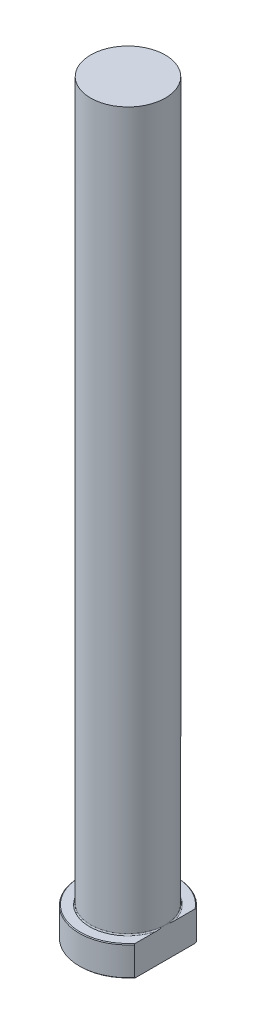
ISO-10303-21;
HEADER;
FILE_DESCRIPTION(('STEP AP214'),'2;1');
FILE_NAME('part.step','',(''),(''),'','','');
FILE_SCHEMA(('AUTOMOTIVE_DESIGN { 1 0 10303 214 1 1 1 1 }'));
ENDSEC;
DATA;
#1=APPLICATION_CONTEXT('core data for automotive mechanical design processes');
#2=APPLICATION_PROTOCOL_DEFINITION('international standard','automotive_design',2000,#1);
#3=PRODUCT_CONTEXT('',#1,'mechanical');
#4=PRODUCT('Part','Part','',(#3));
#5=PRODUCT_RELATED_PRODUCT_CATEGORY('part','',(#4));
#6=PRODUCT_DEFINITION_FORMATION('','',#4);
#7=PRODUCT_DEFINITION_CONTEXT('part definition',#1,'design');
#8=PRODUCT_DEFINITION('design','',#6,#7);
#9=PRODUCT_DEFINITION_SHAPE('','',#8);
#10=(LENGTH_UNIT() NAMED_UNIT(*) SI_UNIT(.MILLI.,.METRE.));
#11=(NAMED_UNIT(*) PLANE_ANGLE_UNIT() SI_UNIT($,.RADIAN.));
#12=(NAMED_UNIT(*) SI_UNIT($,.STERADIAN.) SOLID_ANGLE_UNIT());
#13=UNCERTAINTY_MEASURE_WITH_UNIT(LENGTH_MEASURE(1.E-05),#10,'distance_accuracy_value','');
#14=(GEOMETRIC_REPRESENTATION_CONTEXT(3) GLOBAL_UNCERTAINTY_ASSIGNED_CONTEXT((#13)) GLOBAL_UNIT_ASSIGNED_CONTEXT((#10,
#11,#12)) REPRESENTATION_CONTEXT('',''));
#15=CARTESIAN_POINT('',(0.,0.,0.));
#16=DIRECTION('',(0.,0.,1.));
#17=DIRECTION('',(1.,0.,0.));
#18=AXIS2_PLACEMENT_3D('',#15,#16,#17);
#19=CARTESIAN_POINT('',(0.,0.,0.));
#20=DIRECTION('',(0.,-1.,0.));
#21=DIRECTION('',(0.,0.,-1.));
#22=AXIS2_PLACEMENT_3D('',#19,#20,#21);
#23=PLANE('',#22);
#24=CARTESIAN_POINT('',(0.,0.,0.));
#25=DIRECTION('',(0.,-1.,0.));
#26=DIRECTION('',(0.,0.,-1.));
#27=AXIS2_PLACEMENT_3D('',#24,#25,#26);
#28=CIRCLE('',#27,12.8);
#29=CARTESIAN_POINT('',(9.99999999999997,0.,7.98999374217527));
#30=VERTEX_POINT('',#29);
#31=CARTESIAN_POINT('',(9.99999999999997,0.,-7.98999374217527));
#32=VERTEX_POINT('',#31);
#33=EDGE_CURVE('E98',#30,#32,#28,.T.);
#34=ORIENTED_EDGE('',*,*,#33,.T.);
#35=DIRECTION('',(0.,0.,1.));
#36=VECTOR('',#35,1.);
#37=CARTESIAN_POINT('',(9.99999999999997,0.,-8.30662386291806));
#38=LINE('',#37,#36);
#39=EDGE_CURVE('E83',#32,#30,#38,.T.);
#40=ORIENTED_EDGE('',*,*,#39,.T.);
#41=EDGE_LOOP('',(#34,#40));
#42=FACE_BOUND('',#41,.T.);
#43=ADVANCED_FACE('F32',(#42),#23,.T.);
#44=CARTESIAN_POINT('',(0.,259.958771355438,0.));
#45=DIRECTION('',(0.,1.,0.));
#46=DIRECTION('',(0.,0.,1.));
#47=AXIS2_PLACEMENT_3D('',#44,#45,#46);
#48=CYLINDRICAL_SURFACE('',#47,13.);
#49=CARTESIAN_POINT('',(0.,7.79999999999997,0.));
#50=DIRECTION('',(0.,1.,0.));
#51=DIRECTION('',(0.,0.,1.));
#52=AXIS2_PLACEMENT_3D('',#49,#50,#51);
#53=CIRCLE('',#52,13.);
#54=CARTESIAN_POINT('',(9.99999999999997,7.79999999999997,8.30662386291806));
#55=VERTEX_POINT('',#54);
#56=CARTESIAN_POINT('',(9.99999999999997,7.79999999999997,-8.30662386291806));
#57=VERTEX_POINT('',#56);
#58=EDGE_CURVE('E104',#55,#57,#53,.F.);
#59=ORIENTED_EDGE('',*,*,#58,.T.);
#60=DIRECTION('',(0.,-1.,0.));
#61=VECTOR('',#60,1.);
#62=CARTESIAN_POINT('',(9.99999999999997,200.,-8.30662386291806));
#63=LINE('',#62,#61);
#64=CARTESIAN_POINT('',(9.99999999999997,0.199999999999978,-8.30662386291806));
#65=VERTEX_POINT('',#64);
#66=EDGE_CURVE('E183',#57,#65,#63,.T.);
#67=ORIENTED_EDGE('',*,*,#66,.T.);
#68=CARTESIAN_POINT('',(0.,0.199999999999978,0.));
#69=DIRECTION('',(0.,-1.,0.));
#70=DIRECTION('',(0.,0.,-1.));
#71=AXIS2_PLACEMENT_3D('',#68,#69,#70);
#72=CIRCLE('',#71,13.);
#73=CARTESIAN_POINT('',(9.99999999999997,0.199999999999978,8.30662386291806));
#74=VERTEX_POINT('',#73);
#75=EDGE_CURVE('E100',#65,#74,#72,.F.);
#76=ORIENTED_EDGE('',*,*,#75,.T.);
#77=DIRECTION('',(0.,-1.,0.));
#78=VECTOR('',#77,1.);
#79=CARTESIAN_POINT('',(9.99999999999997,200.,8.30662386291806));
#80=LINE('',#79,#78);
#81=EDGE_CURVE('E93',#55,#74,#80,.T.);
#82=ORIENTED_EDGE('',*,*,#81,.F.);
#83=EDGE_LOOP('',(#59,#67,#76,#82));
#84=FACE_BOUND('',#83,.T.);
#85=ADVANCED_FACE('F158',(#84),#48,.T.);
#86=CARTESIAN_POINT('',(-13.,8.,0.));
#87=DIRECTION('',(0.,1.,0.));
#88=DIRECTION('',(0.,0.,1.));
#89=AXIS2_PLACEMENT_3D('',#86,#87,#88);
#90=PLANE('',#89);
#91=CARTESIAN_POINT('',(0.,8.,0.));
#92=DIRECTION('',(0.,1.,0.));
#93=DIRECTION('',(0.,0.,1.));
#94=AXIS2_PLACEMENT_3D('',#91,#92,#93);
#95=CIRCLE('',#94,12.8);
#96=CARTESIAN_POINT('',(9.99999999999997,8.,-7.98999374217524));
#97=VERTEX_POINT('',#96);
#98=CARTESIAN_POINT('',(9.99999999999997,8.,7.98999374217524));
#99=VERTEX_POINT('',#98);
#100=EDGE_CURVE('E178',#97,#99,#95,.T.);
#101=ORIENTED_EDGE('',*,*,#100,.T.);
#102=DIRECTION('',(0.,0.,-1.));
#103=VECTOR('',#102,1.);
#104=CARTESIAN_POINT('',(9.99999999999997,8.,0.));
#105=LINE('',#104,#103);
#106=CARTESIAN_POINT('',(9.99999999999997,7.99999999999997,2.46779253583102));
#107=VERTEX_POINT('',#106);
#108=EDGE_CURVE('E57',#99,#107,#105,.T.);
#109=ORIENTED_EDGE('',*,*,#108,.T.);
#110=CARTESIAN_POINT('',(0.,8.,0.));
#111=DIRECTION('',(0.,1.,0.));
#112=DIRECTION('',(0.,0.,1.));
#113=AXIS2_PLACEMENT_3D('',#110,#111,#112);
#114=CIRCLE('',#113,10.3);
#115=CARTESIAN_POINT('',(9.99999999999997,7.99999999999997,-2.4677925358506));
#116=VERTEX_POINT('',#115);
#117=EDGE_CURVE('E107',#107,#116,#114,.F.);
#118=ORIENTED_EDGE('',*,*,#117,.T.);
#119=EDGE_CURVE('E136',#116,#97,#105,.T.);
#120=ORIENTED_EDGE('',*,*,#119,.T.);
#121=EDGE_LOOP('',(#101,#109,#118,#120));
#122=FACE_BOUND('',#121,.T.);
#123=ADVANCED_FACE('F147',(#122),#90,.T.);
#124=CARTESIAN_POINT('',(0.,8.00000000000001,0.));
#125=DIRECTION('',(0.,-1.,0.));
#126=DIRECTION('',(0.,0.,-1.));
#127=AXIS2_PLACEMENT_3D('',#124,#125,#126);
#128=CONICAL_SURFACE('',#127,12.8,0.785398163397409);
#129=ORIENTED_EDGE('',*,*,#58,.F.);
#130=CARTESIAN_POINT('',(9.99999999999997,-0.0325156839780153,18.2754947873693));
#131=CARTESIAN_POINT('',(9.99999999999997,0.202654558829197,18.0074110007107));
#132=CARTESIAN_POINT('',(9.99999999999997,0.437161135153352,17.7387434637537));
#133=CARTESIAN_POINT('',(9.99999999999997,0.904653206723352,17.2000818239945));
#134=CARTESIAN_POINT('',(9.99999999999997,1.13763868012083,16.9300877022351));
#135=CARTESIAN_POINT('',(9.99999999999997,1.60198918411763,16.3885035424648));
#136=CARTESIAN_POINT('',(9.99999999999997,1.83335346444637,16.1169128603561));
#137=CARTESIAN_POINT('',(9.99999999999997,2.29410614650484,15.5720644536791));
#138=CARTESIAN_POINT('',(9.99999999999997,2.52349455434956,15.2988067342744));
#139=CARTESIAN_POINT('',(9.99999999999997,3.21725580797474,14.4654539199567));
#140=CARTESIAN_POINT('',(9.99999999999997,3.67808931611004,13.9023903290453));
#141=CARTESIAN_POINT('',(9.99999999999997,4.35978968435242,13.0502618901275));
#142=CARTESIAN_POINT('',(9.99999999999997,4.5854079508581,12.7649943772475));
#143=CARTESIAN_POINT('',(9.99999999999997,5.03290011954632,12.1915402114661));
#144=CARTESIAN_POINT('',(9.99999999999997,5.25477408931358,11.9033536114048));
#145=CARTESIAN_POINT('',(9.99999999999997,5.69431250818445,11.3233226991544));
#146=CARTESIAN_POINT('',(9.99999999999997,5.91197246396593,11.0314749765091));
#147=CARTESIAN_POINT('',(9.99999999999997,6.3419766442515,10.4438760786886));
#148=CARTESIAN_POINT('',(9.99999999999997,6.55432081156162,10.148124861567));
#149=CARTESIAN_POINT('',(9.99999999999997,6.97275454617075,9.55185224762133));
#150=CARTESIAN_POINT('',(9.99999999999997,7.17883878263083,9.25132709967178));
#151=CARTESIAN_POINT('',(9.99999999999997,7.58314110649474,8.64502234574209));
#152=CARTESIAN_POINT('',(9.99999999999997,7.78135936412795,8.33924285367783));
#153=CARTESIAN_POINT('',(9.99999999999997,8.16699130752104,7.72335702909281));
#154=CARTESIAN_POINT('',(9.99999999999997,8.35446043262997,7.41328556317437));
#155=CARTESIAN_POINT('',(9.99999999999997,8.71750578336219,6.78616658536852));
#156=CARTESIAN_POINT('',(9.99999999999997,8.89308056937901,6.46911823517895));
#157=CARTESIAN_POINT('',(9.99999999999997,9.22907765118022,5.82759086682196));
#158=CARTESIAN_POINT('',(9.99999999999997,9.38952050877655,5.50312269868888));
#159=CARTESIAN_POINT('',(9.99999999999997,9.69166927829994,4.84563633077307));
#160=CARTESIAN_POINT('',(9.99999999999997,9.83338220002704,4.51262138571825));
#161=CARTESIAN_POINT('',(9.99999999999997,10.0965229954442,3.82962418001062));
#162=CARTESIAN_POINT('',(9.99999999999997,10.217400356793,3.47942732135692));
#163=CARTESIAN_POINT('',(9.99999999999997,10.4289934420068,2.76986167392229));
#164=CARTESIAN_POINT('',(9.99999999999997,10.5197138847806,2.4104943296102));
#165=CARTESIAN_POINT('',(9.99999999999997,10.6286544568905,1.86748514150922));
#166=CARTESIAN_POINT('',(9.99999999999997,10.6603769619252,1.68649705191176));
#167=CARTESIAN_POINT('',(9.99999999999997,10.7144435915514,1.32313476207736));
#168=CARTESIAN_POINT('',(9.99999999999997,10.7367891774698,1.14076078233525));
#169=CARTESIAN_POINT('',(9.99999999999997,10.7716587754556,0.775084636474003));
#170=CARTESIAN_POINT('',(9.99999999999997,10.784183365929,0.591782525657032));
#171=CARTESIAN_POINT('',(9.99999999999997,10.799154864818,0.224764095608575));
#172=CARTESIAN_POINT('',(9.99999999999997,10.8016017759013,0.0410477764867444));
#173=CARTESIAN_POINT('',(9.99999999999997,10.7963538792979,-0.327017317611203));
#174=CARTESIAN_POINT('',(9.99999999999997,10.7886160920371,-0.511365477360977));
#175=CARTESIAN_POINT('',(9.99999999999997,10.7630873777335,-0.879387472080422));
#176=CARTESIAN_POINT('',(9.99999999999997,10.745294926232,-1.06306120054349));
#177=CARTESIAN_POINT('',(9.99999999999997,10.7000178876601,-1.42920996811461));
#178=CARTESIAN_POINT('',(9.99999999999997,10.6725330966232,-1.61168498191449));
#179=CARTESIAN_POINT('',(9.99999999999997,10.6083992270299,-1.97502817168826));
#180=CARTESIAN_POINT('',(9.99999999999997,10.571748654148,-2.15589608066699));
#181=CARTESIAN_POINT('',(9.99999999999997,10.4483311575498,-2.69844589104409));
#182=CARTESIAN_POINT('',(9.99999999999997,10.3484702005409,-3.0571987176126));
#183=CARTESIAN_POINT('',(9.99999999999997,10.1199208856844,-3.7651832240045));
#184=CARTESIAN_POINT('',(9.99999999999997,9.99123071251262,-4.11441430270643));
#185=CARTESIAN_POINT('',(9.99999999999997,9.68849468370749,-4.8578170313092));
#186=CARTESIAN_POINT('',(9.99999999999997,9.51049481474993,-5.25036497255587));
#187=CARTESIAN_POINT('',(9.99999999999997,9.13067200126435,-6.02385434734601));
#188=CARTESIAN_POINT('',(9.99999999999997,8.92883580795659,-6.40478917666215));
#189=CARTESIAN_POINT('',(9.99999999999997,8.50660482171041,-7.15714025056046));
#190=CARTESIAN_POINT('',(9.99999999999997,8.28617401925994,-7.52853612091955));
#191=CARTESIAN_POINT('',(9.99999999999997,7.83133827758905,-8.26251132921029));
#192=CARTESIAN_POINT('',(9.99999999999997,7.59693601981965,-8.62509234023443));
#193=CARTESIAN_POINT('',(9.99999999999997,7.11586721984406,-9.34492022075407));
#194=CARTESIAN_POINT('',(9.99999999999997,6.86913954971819,-9.70212604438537));
#195=CARTESIAN_POINT('',(9.99999999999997,6.36695123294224,-10.4103413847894));
#196=CARTESIAN_POINT('',(9.99999999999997,6.11149026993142,-10.7613506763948));
#197=CARTESIAN_POINT('',(9.99999999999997,5.59387477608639,-11.4577672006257));
#198=CARTESIAN_POINT('',(9.99999999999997,5.33172815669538,-11.803180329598));
#199=CARTESIAN_POINT('',(9.99999999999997,4.80177954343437,-12.4896197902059));
#200=CARTESIAN_POINT('',(9.99999999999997,4.53397765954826,-12.8306462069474));
#201=CARTESIAN_POINT('',(9.99999999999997,3.91508653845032,-13.6077378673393));
#202=CARTESIAN_POINT('',(9.99999999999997,3.56244770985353,-14.0425677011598));
#203=CARTESIAN_POINT('',(9.99999999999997,2.8509908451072,-14.907287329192));
#204=CARTESIAN_POINT('',(9.99999999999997,2.49217148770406,-15.3371760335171));
#205=CARTESIAN_POINT('',(9.99999999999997,1.77449197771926,-16.1870689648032));
#206=CARTESIAN_POINT('',(9.99999999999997,1.41569709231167,-16.6071284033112));
#207=CARTESIAN_POINT('',(9.99999999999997,0.694277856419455,-17.4437464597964));
#208=CARTESIAN_POINT('',(9.99999999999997,0.331654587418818,-17.860306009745));
#209=CARTESIAN_POINT('',(9.99999999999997,-0.0325156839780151,-18.2754947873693));
#210=B_SPLINE_CURVE_WITH_KNOTS('',3,(#130,#131,#132,#133,#134,#135,#136,#137,#138,#139,#140,
#141,#142,#143,#144,#145,#146,#147,#148,#149,#150,#151,#152,#153,#154,#155,#156,#157,#158,#159,
#160,#161,#162,#163,#164,#165,#166,#167,#168,#169,#170,#171,#172,#173,#174,#175,#176,#177,#178,
#179,#180,#181,#182,#183,#184,#185,#186,#187,#188,#189,#190,#191,#192,#193,#194,#195,#196,#197,
#198,#199,#200,#201,#202,#203,#204,#205,#206,#207,#208,#209),.UNSPECIFIED.,.F.,.F.,(4,2,2,2,2,2,
2,2,2,2,2,2,2,2,2,2,2,2,2,2,2,2,2,2,2,2,2,2,2,2,2,2,2,2,2,2,2,2,2,4),(0.,1.06984422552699,
2.13970378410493,3.21002948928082,4.28035188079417,6.46299853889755,7.55408928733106,
8.64516032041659,9.73733693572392,10.8295252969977,11.9226190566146,13.0156891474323,
14.1024911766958,15.1894245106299,16.2748589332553,17.3598859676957,18.4702319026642,
19.5804040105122,20.1314403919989,20.6823908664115,21.2333088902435,21.7842267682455,
22.3374769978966,22.890811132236,23.44415691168,23.9975929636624,25.1131246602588,
26.2287266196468,27.5206979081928,28.8133907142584,30.1086470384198,31.4036555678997,
32.7058891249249,34.0081699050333,35.3089752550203,36.609755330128,38.2892289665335,
39.9690662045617,41.6263430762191,43.283163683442),.UNSPECIFIED.);
#211=EDGE_CURVE('E135',#55,#99,#210,.T.);
#212=ORIENTED_EDGE('',*,*,#211,.T.);
#213=ORIENTED_EDGE('',*,*,#100,.F.);
#214=EDGE_CURVE('E127',#97,#57,#210,.T.);
#215=ORIENTED_EDGE('',*,*,#214,.T.);
#216=EDGE_LOOP('',(#129,#212,#213,#215));
#217=FACE_BOUND('',#216,.T.);
#218=ADVANCED_FACE('F143',(#217),#128,.T.);
#219=CARTESIAN_POINT('',(0.,0.199999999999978,0.));
#220=DIRECTION('',(0.,1.,0.));
#221=DIRECTION('',(0.,0.,1.));
#222=AXIS2_PLACEMENT_3D('',#219,#220,#221);
#223=CONICAL_SURFACE('',#222,13.,0.785398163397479);
#224=ORIENTED_EDGE('',*,*,#75,.F.);
#225=CARTESIAN_POINT('',(9.99999999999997,8.03251568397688,-18.2754947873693));
#226=CARTESIAN_POINT('',(9.99999999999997,7.79734544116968,-18.0074110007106));
#227=CARTESIAN_POINT('',(9.99999999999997,7.56283886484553,-17.7387434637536));
#228=CARTESIAN_POINT('',(9.99999999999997,7.09534679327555,-17.2000818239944));
#229=CARTESIAN_POINT('',(9.99999999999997,6.86236131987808,-16.930087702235));
#230=CARTESIAN_POINT('',(9.99999999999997,6.39801081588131,-16.3885035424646));
#231=CARTESIAN_POINT('',(9.99999999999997,6.16664653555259,-16.1169128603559));
#232=CARTESIAN_POINT('',(9.99999999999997,5.70589385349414,-15.5720644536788));
#233=CARTESIAN_POINT('',(9.99999999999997,5.47650544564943,-15.2988067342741));
#234=CARTESIAN_POINT('',(9.99999999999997,4.78274419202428,-14.4654539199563));
#235=CARTESIAN_POINT('',(9.99999999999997,4.32191068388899,-13.9023903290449));
#236=CARTESIAN_POINT('',(9.99999999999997,3.64021031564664,-13.050261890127));
#237=CARTESIAN_POINT('',(9.99999999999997,3.41459204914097,-12.764994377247));
#238=CARTESIAN_POINT('',(9.99999999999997,2.96709988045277,-12.1915402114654));
#239=CARTESIAN_POINT('',(9.99999999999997,2.74522591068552,-11.9033536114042));
#240=CARTESIAN_POINT('',(9.99999999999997,2.30568749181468,-11.3233226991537));
#241=CARTESIAN_POINT('',(9.99999999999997,2.08802753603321,-11.0314749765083));
#242=CARTESIAN_POINT('',(9.99999999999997,1.65802335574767,-10.4438760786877));
#243=CARTESIAN_POINT('',(9.99999999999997,1.44567918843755,-10.1481248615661));
#244=CARTESIAN_POINT('',(9.99999999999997,1.02724545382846,-9.55185224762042));
#245=CARTESIAN_POINT('',(9.99999999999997,0.821161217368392,-9.25132709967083));
#246=CARTESIAN_POINT('',(9.99999999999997,0.416858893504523,-8.64502234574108));
#247=CARTESIAN_POINT('',(9.99999999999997,0.218640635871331,-8.33924285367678));
#248=CARTESIAN_POINT('',(9.99999999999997,-0.166991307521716,-7.72335702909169));
#249=CARTESIAN_POINT('',(9.99999999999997,-0.354460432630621,-7.41328556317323));
#250=CARTESIAN_POINT('',(9.99999999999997,-0.717505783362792,-6.78616658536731));
#251=CARTESIAN_POINT('',(9.99999999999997,-0.893080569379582,-6.46911823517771));
#252=CARTESIAN_POINT('',(9.99999999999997,-1.22907765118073,-5.82759086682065));
#253=CARTESIAN_POINT('',(9.99999999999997,-1.38952050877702,-5.50312269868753));
#254=CARTESIAN_POINT('',(9.99999999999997,-1.69166927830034,-4.84563633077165));
#255=CARTESIAN_POINT('',(9.99999999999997,-1.8333822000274,-4.5126213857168));
#256=CARTESIAN_POINT('',(9.99999999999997,-2.09652299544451,-3.82962418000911));
#257=CARTESIAN_POINT('',(9.99999999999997,-2.21740035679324,-3.47942732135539));
#258=CARTESIAN_POINT('',(9.99999999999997,-2.42899344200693,-2.76986167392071));
#259=CARTESIAN_POINT('',(9.99999999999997,-2.51971388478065,-2.41049432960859));
#260=CARTESIAN_POINT('',(9.99999999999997,-2.6286544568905,-1.86748514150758));
#261=CARTESIAN_POINT('',(9.99999999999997,-2.66037696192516,-1.68649705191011));
#262=CARTESIAN_POINT('',(9.99999999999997,-2.71444359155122,-1.32313476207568));
#263=CARTESIAN_POINT('',(9.99999999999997,-2.73678917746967,-1.14076078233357));
#264=CARTESIAN_POINT('',(9.99999999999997,-2.7716587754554,-0.775084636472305));
#265=CARTESIAN_POINT('',(9.99999999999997,-2.7841833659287,-0.591782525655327));
#266=CARTESIAN_POINT('',(9.99999999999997,-2.79915486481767,-0.224764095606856));
#267=CARTESIAN_POINT('',(9.99999999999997,-2.80160177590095,-0.0410477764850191));
#268=CARTESIAN_POINT('',(9.99999999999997,-2.79635387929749,0.327017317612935));
#269=CARTESIAN_POINT('',(9.99999999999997,-2.78861609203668,0.511365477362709));
#270=CARTESIAN_POINT('',(9.99999999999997,-2.76308737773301,0.879387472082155));
#271=CARTESIAN_POINT('',(9.99999999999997,-2.74529492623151,1.06306120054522));
#272=CARTESIAN_POINT('',(9.99999999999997,-2.70001788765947,1.42920996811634));
#273=CARTESIAN_POINT('',(9.99999999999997,-2.67253309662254,1.61168498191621));
#274=CARTESIAN_POINT('',(9.99999999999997,-2.60839922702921,1.97502817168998));
#275=CARTESIAN_POINT('',(9.99999999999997,-2.57174865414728,2.15589608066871));
#276=CARTESIAN_POINT('',(9.99999999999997,-2.44833115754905,2.69844589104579));
#277=CARTESIAN_POINT('',(9.99999999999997,-2.34847020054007,3.0571987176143));
#278=CARTESIAN_POINT('',(9.99999999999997,-2.11992088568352,3.76518322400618));
#279=CARTESIAN_POINT('',(9.99999999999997,-1.99123071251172,4.1144143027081));
#280=CARTESIAN_POINT('',(9.99999999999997,-1.68849468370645,4.85781703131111));
#281=CARTESIAN_POINT('',(9.99999999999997,-1.51049481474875,5.250364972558));
#282=CARTESIAN_POINT('',(9.99999999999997,-1.13067200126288,6.02385434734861));
#283=CARTESIAN_POINT('',(9.99999999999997,-0.928835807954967,6.40478917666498));
#284=CARTESIAN_POINT('',(9.99999999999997,-0.506604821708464,7.15714025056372));
#285=CARTESIAN_POINT('',(9.99999999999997,-0.286174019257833,7.52853612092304));
#286=CARTESIAN_POINT('',(9.99999999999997,0.168661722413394,8.2625113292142));
#287=CARTESIAN_POINT('',(9.99999999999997,0.403063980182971,8.62509234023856));
#288=CARTESIAN_POINT('',(9.99999999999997,0.884132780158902,9.34492022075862));
#289=CARTESIAN_POINT('',(9.99999999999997,1.13086045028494,9.70212604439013));
#290=CARTESIAN_POINT('',(9.99999999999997,1.63304876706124,10.4103413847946));
#291=CARTESIAN_POINT('',(9.99999999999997,1.88850973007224,10.7613506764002));
#292=CARTESIAN_POINT('',(9.99999999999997,2.40612522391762,11.4577672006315));
#293=CARTESIAN_POINT('',(9.99999999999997,2.6682718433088,11.803180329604));
#294=CARTESIAN_POINT('',(9.99999999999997,3.19822045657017,12.4896197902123));
#295=CARTESIAN_POINT('',(9.99999999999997,3.46602234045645,12.8306462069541));
#296=CARTESIAN_POINT('',(9.99999999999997,4.08491346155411,13.6077378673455));
#297=CARTESIAN_POINT('',(9.99999999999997,4.4375522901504,14.0425677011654));
#298=CARTESIAN_POINT('',(9.99999999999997,5.14900915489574,14.9072873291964));
#299=CARTESIAN_POINT('',(9.99999999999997,5.50782851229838,15.337176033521));
#300=CARTESIAN_POINT('',(9.99999999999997,6.22550802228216,16.1870689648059));
#301=CARTESIAN_POINT('',(9.99999999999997,6.58430290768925,16.6071284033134));
#302=CARTESIAN_POINT('',(9.99999999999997,7.30572214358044,17.4437464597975));
#303=CARTESIAN_POINT('',(9.99999999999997,7.66834541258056,17.8603060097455));
#304=CARTESIAN_POINT('',(9.99999999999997,8.03251568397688,18.2754947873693));
#305=B_SPLINE_CURVE_WITH_KNOTS('',3,(#225,#226,#227,#228,#229,#230,#231,#232,#233,#234,#235,
#236,#237,#238,#239,#240,#241,#242,#243,#244,#245,#246,#247,#248,#249,#250,#251,#252,#253,#254,
#255,#256,#257,#258,#259,#260,#261,#262,#263,#264,#265,#266,#267,#268,#269,#270,#271,#272,#273,
#274,#275,#276,#277,#278,#279,#280,#281,#282,#283,#284,#285,#286,#287,#288,#289,#290,#291,#292,
#293,#294,#295,#296,#297,#298,#299,#300,#301,#302,#303,#304),.UNSPECIFIED.,.F.,.F.,(4,2,2,2,2,2,
2,2,2,2,2,2,2,2,2,2,2,2,2,2,2,2,2,2,2,2,2,2,2,2,2,2,2,2,2,2,2,2,2,4),(0.,1.06984422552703,
2.139703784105,3.21002948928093,4.28035188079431,6.4629985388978,7.55408928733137,
8.64516032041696,9.73733693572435,10.8295252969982,11.9226190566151,13.0156891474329,
14.1024911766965,15.1894245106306,16.274858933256,17.3598859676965,18.470231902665,
19.580404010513,20.1314403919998,20.6823908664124,21.2333088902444,21.7842267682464,
22.3374769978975,22.8908111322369,23.4441569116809,23.9975929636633,25.1131246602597,
26.2287266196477,27.5206979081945,28.813390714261,30.1086470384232,31.4036555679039,
32.7058891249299,34.0081699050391,35.308975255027,36.6097553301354,38.2892289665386,
39.9690662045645,41.6263430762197,43.2831636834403),.UNSPECIFIED.);
#306=EDGE_CURVE('E86',#65,#32,#305,.T.);
#307=ORIENTED_EDGE('',*,*,#306,.T.);
#308=ORIENTED_EDGE('',*,*,#33,.F.);
#309=EDGE_CURVE('E89',#30,#74,#305,.T.);
#310=ORIENTED_EDGE('',*,*,#309,.T.);
#311=EDGE_LOOP('',(#224,#307,#308,#310));
#312=FACE_BOUND('',#311,.T.);
#313=ADVANCED_FACE('F97',(#312),#223,.T.);
#314=CARTESIAN_POINT('',(0.,8.29999999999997,0.));
#315=DIRECTION('',(0.,1.,0.));
#316=DIRECTION('',(0.,0.,1.));
#317=AXIS2_PLACEMENT_3D('',#314,#315,#316);
#318=TOROIDAL_SURFACE('',#317,10.3,0.3);
#319=CARTESIAN_POINT('',(9.99999999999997,8.29999999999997,0.));
#320=CARTESIAN_POINT('',(9.99999999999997,8.3000006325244,1.2894927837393E-10));
#321=CARTESIAN_POINT('',(9.99999999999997,8.30000126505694,-4.00092931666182E-07));
#322=CARTESIAN_POINT('',(9.99999999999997,8.30000243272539,-1.40234418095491E-06));
#323=CARTESIAN_POINT('',(9.99999999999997,8.30000291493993,-2.02945823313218E-06));
#324=CARTESIAN_POINT('',(9.99999999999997,8.30000399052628,-3.57386628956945E-06));
#325=CARTESIAN_POINT('',(9.99999999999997,8.30000456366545,-4.5158581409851E-06));
#326=CARTESIAN_POINT('',(9.99999999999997,8.30000552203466,-6.39352358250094E-06));
#327=CARTESIAN_POINT('',(9.99999999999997,8.3000059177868,-7.32481303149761E-06));
#328=CARTESIAN_POINT('',(9.99999999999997,8.30000752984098,-1.11866731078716E-05));
#329=CARTESIAN_POINT('',(9.99999999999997,8.30000869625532,-1.41456078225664E-05));
#330=CARTESIAN_POINT('',(9.99999999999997,8.30001046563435,-1.98041770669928E-05));
#331=CARTESIAN_POINT('',(9.99999999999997,8.30001112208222,-2.2487618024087E-05));
#332=CARTESIAN_POINT('',(9.99999999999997,8.30001410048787,-3.44834818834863E-05));
#333=CARTESIAN_POINT('',(9.99999999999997,8.30001652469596,-4.37702043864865E-05));
#334=CARTESIAN_POINT('',(9.99999999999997,8.30001986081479,-6.08623690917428E-05));
#335=CARTESIAN_POINT('',(9.99999999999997,8.30002096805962,-6.86285921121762E-05));
#336=CARTESIAN_POINT('',(9.99999999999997,8.3000293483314,-0.00012805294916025));
#337=CARTESIAN_POINT('',(9.99999999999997,8.30003610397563,-0.000179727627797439));
#338=CARTESIAN_POINT('',(9.99999999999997,8.30006561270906,-0.00038619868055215));
#339=CARTESIAN_POINT('',(9.99999999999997,8.30009331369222,-0.000540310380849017));
#340=CARTESIAN_POINT('',(9.99999999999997,8.30020264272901,-0.00115673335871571));
#341=CARTESIAN_POINT('',(9.99999999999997,8.30028138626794,-0.00161935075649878));
#342=CARTESIAN_POINT('',(9.99999999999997,8.30059961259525,-0.00347761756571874));
#343=CARTESIAN_POINT('',(9.99999999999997,8.30084290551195,-0.0048728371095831));
#344=CARTESIAN_POINT('',(9.99999999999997,8.30186502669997,-0.0107472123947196));
#345=CARTESIAN_POINT('',(9.99999999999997,8.30263902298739,-0.0152269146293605));
#346=CARTESIAN_POINT('',(9.99999999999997,8.31278939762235,-0.0739588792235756));
#347=CARTESIAN_POINT('',(9.99999999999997,8.32219581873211,-0.128207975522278));
#348=CARTESIAN_POINT('',(9.99999999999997,8.34198671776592,-0.242894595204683));
#349=CARTESIAN_POINT('',(9.99999999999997,8.35236068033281,-0.303333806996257));
#350=CARTESIAN_POINT('',(9.99999999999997,8.3697713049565,-0.405616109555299));
#351=CARTESIAN_POINT('',(9.99999999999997,8.3768514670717,-0.447451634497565));
#352=CARTESIAN_POINT('',(9.99999999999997,8.39069208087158,-0.529918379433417));
#353=CARTESIAN_POINT('',(9.99999999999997,8.39745582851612,-0.570549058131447));
#354=CARTESIAN_POINT('',(9.99999999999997,8.4352494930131,-0.799879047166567));
#355=CARTESIAN_POINT('',(9.99999999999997,8.46492511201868,-0.988816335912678));
#356=CARTESIAN_POINT('',(9.99999999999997,8.50514159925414,-1.27416595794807));
#357=CARTESIAN_POINT('',(9.99999999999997,8.51790226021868,-1.37026272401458));
#358=CARTESIAN_POINT('',(9.99999999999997,8.54137601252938,-1.56269877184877));
#359=CARTESIAN_POINT('',(9.99999999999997,8.55208934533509,-1.65903802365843));
#360=CARTESIAN_POINT('',(9.99999999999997,8.57171635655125,-1.86082905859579));
#361=CARTESIAN_POINT('',(9.99999999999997,8.58037484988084,-1.96630619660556));
#362=CARTESIAN_POINT('',(9.99999999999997,8.59347501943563,-2.17764173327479));
#363=CARTESIAN_POINT('',(9.99999999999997,8.59791297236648,-2.28350038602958));
#364=CARTESIAN_POINT('',(9.99999999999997,8.60018116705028,-2.44194031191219));
#365=CARTESIAN_POINT('',(9.99999999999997,8.60021412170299,-2.49449016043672));
#366=CARTESIAN_POINT('',(9.99999999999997,8.5985468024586,-2.59955991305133));
#367=CARTESIAN_POINT('',(9.99999999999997,8.59684676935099,-2.65207982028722));
#368=CARTESIAN_POINT('',(9.99999999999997,8.59132943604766,-2.7569292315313));
#369=CARTESIAN_POINT('',(9.99999999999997,8.58751547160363,-2.80925890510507));
#370=CARTESIAN_POINT('',(9.99999999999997,8.57721394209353,-2.91364681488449));
#371=CARTESIAN_POINT('',(9.99999999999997,8.57072778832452,-2.96570517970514));
#372=CARTESIAN_POINT('',(9.99999999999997,8.55845909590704,-3.04236198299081));
#373=CARTESIAN_POINT('',(9.99999999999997,8.55406015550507,-3.06718232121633));
#374=CARTESIAN_POINT('',(9.99999999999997,8.54426309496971,-3.11664708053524));
#375=CARTESIAN_POINT('',(9.99999999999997,8.53886425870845,-3.14129136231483));
#376=CARTESIAN_POINT('',(9.99999999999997,8.52688550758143,-3.19015398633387));
#377=CARTESIAN_POINT('',(9.99999999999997,8.52031210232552,-3.21437390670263));
#378=CARTESIAN_POINT('',(9.99999999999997,8.50565284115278,-3.26234404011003));
#379=CARTESIAN_POINT('',(9.99999999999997,8.49756823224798,-3.2860946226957));
#380=CARTESIAN_POINT('',(9.99999999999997,8.47930616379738,-3.33303874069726));
#381=CARTESIAN_POINT('',(9.99999999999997,8.46910978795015,-3.35622496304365));
#382=CARTESIAN_POINT('',(9.99999999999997,8.44583688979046,-3.40109767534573));
#383=CARTESIAN_POINT('',(9.99999999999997,8.43277518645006,-3.4227911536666));
#384=CARTESIAN_POINT('',(9.99999999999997,8.41234422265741,-3.44947282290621));
#385=CARTESIAN_POINT('',(9.99999999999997,8.40696910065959,-3.45597309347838));
#386=CARTESIAN_POINT('',(9.99999999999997,8.39560437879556,-3.46843629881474));
#387=CARTESIAN_POINT('',(9.99999999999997,8.38961405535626,-3.47439858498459));
#388=CARTESIAN_POINT('',(9.99999999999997,8.37686927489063,-3.48560282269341));
#389=CARTESIAN_POINT('',(9.99999999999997,8.37010747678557,-3.49083658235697));
#390=CARTESIAN_POINT('',(9.99999999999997,8.3558159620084,-3.50012893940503));
#391=CARTESIAN_POINT('',(9.99999999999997,8.34828839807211,-3.50419071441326));
#392=CARTESIAN_POINT('',(9.99999999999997,8.33495256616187,-3.50966904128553));
#393=CARTESIAN_POINT('',(9.99999999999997,8.32932210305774,-3.5115146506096));
#394=CARTESIAN_POINT('',(9.99999999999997,8.31783314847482,-3.51424608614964));
#395=CARTESIAN_POINT('',(9.99999999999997,8.31197492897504,-3.5151330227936));
#396=CARTESIAN_POINT('',(9.99999999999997,8.30017128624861,-3.51585458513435));
#397=CARTESIAN_POINT('',(9.99999999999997,8.29422562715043,-3.5156854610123));
#398=CARTESIAN_POINT('',(9.99999999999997,8.28245600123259,-3.5143060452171));
#399=CARTESIAN_POINT('',(9.99999999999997,8.2766321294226,-3.51309496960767));
#400=CARTESIAN_POINT('',(9.99999999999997,8.26408629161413,-3.50941038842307));
#401=CARTESIAN_POINT('',(9.99999999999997,8.25742641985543,-3.50672823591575));
#402=CARTESIAN_POINT('',(9.99999999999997,8.2446282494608,-3.50032629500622));
#403=CARTESIAN_POINT('',(9.99999999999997,8.23849100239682,-3.49660447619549));
#404=CARTESIAN_POINT('',(9.99999999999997,8.22322836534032,-3.48593836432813));
#405=CARTESIAN_POINT('',(9.99999999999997,8.21452212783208,-3.47840118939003));
#406=CARTESIAN_POINT('',(9.99999999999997,8.19829740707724,-3.46215047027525));
#407=CARTESIAN_POINT('',(9.99999999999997,8.19078248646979,-3.45343353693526));
#408=CARTESIAN_POINT('',(9.99999999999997,8.16907103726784,-3.42543186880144));
#409=CARTESIAN_POINT('',(9.99999999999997,8.15646161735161,-3.40493410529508));
#410=CARTESIAN_POINT('',(9.99999999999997,8.13394130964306,-3.36256849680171));
#411=CARTESIAN_POINT('',(9.99999999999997,8.12403585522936,-3.34069800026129));
#412=CARTESIAN_POINT('',(9.99999999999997,8.10001076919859,-3.28102790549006));
#413=CARTESIAN_POINT('',(9.99999999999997,8.08762395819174,-3.24253659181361));
#414=CARTESIAN_POINT('',(9.99999999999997,8.06625855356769,-3.16459452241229));
#415=CARTESIAN_POINT('',(9.99999999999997,8.05728845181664,-3.12514163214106));
#416=CARTESIAN_POINT('',(9.99999999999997,8.04173697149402,-3.04517405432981));
#417=CARTESIAN_POINT('',(9.99999999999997,8.03519245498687,-3.00465227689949));
#418=CARTESIAN_POINT('',(9.99999999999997,8.02409415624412,-2.9234105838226));
#419=CARTESIAN_POINT('',(9.99999999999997,8.0195374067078,-2.8826910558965));
#420=CARTESIAN_POINT('',(9.99999999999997,8.00795421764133,-2.7573453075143));
#421=CARTESIAN_POINT('',(9.99999999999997,8.00352270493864,-2.67248037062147));
#422=CARTESIAN_POINT('',(9.99999999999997,7.9993551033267,-2.50262077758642));
#423=CARTESIAN_POINT('',(9.99999999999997,7.99962236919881,-2.41762607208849));
#424=CARTESIAN_POINT('',(9.99999999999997,8.00371104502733,-2.24733475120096));
#425=CARTESIAN_POINT('',(9.99999999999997,8.00754894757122,-2.16203856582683));
#426=CARTESIAN_POINT('',(9.99999999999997,8.01800314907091,-1.99161257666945));
#427=CARTESIAN_POINT('',(9.99999999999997,8.02461987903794,-1.90648280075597));
#428=CARTESIAN_POINT('',(9.99999999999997,8.04643179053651,-1.66587956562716));
#429=CARTESIAN_POINT('',(9.99999999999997,8.06418968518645,-1.51064125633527));
#430=CARTESIAN_POINT('',(9.99999999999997,8.10422160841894,-1.20249798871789));
#431=CARTESIAN_POINT('',(9.99999999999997,8.12644437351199,-1.04958602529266));
#432=CARTESIAN_POINT('',(9.99999999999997,8.15948239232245,-0.836243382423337));
#433=CARTESIAN_POINT('',(9.99999999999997,8.16909985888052,-0.775623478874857));
#434=CARTESIAN_POINT('',(9.99999999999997,8.18897079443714,-0.652687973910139));
#435=CARTESIAN_POINT('',(9.99999999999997,8.1992346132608,-0.590374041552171));
#436=CARTESIAN_POINT('',(9.99999999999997,8.21713663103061,-0.483134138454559));
#437=CARTESIAN_POINT('',(9.99999999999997,8.22471025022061,-0.438197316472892));
#438=CARTESIAN_POINT('',(9.99999999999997,8.2398772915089,-0.348851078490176));
#439=CARTESIAN_POINT('',(9.99999999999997,8.24746951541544,-0.30444145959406));
#440=CARTESIAN_POINT('',(9.99999999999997,8.26182028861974,-0.220832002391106));
#441=CARTESIAN_POINT('',(9.99999999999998,8.26857235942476,-0.181631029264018));
#442=CARTESIAN_POINT('',(9.99999999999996,8.28242621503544,-0.101524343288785));
#443=CARTESIAN_POINT('',(9.99999999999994,8.2895303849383,-0.0606190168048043));
#444=CARTESIAN_POINT('',(9.99999999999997,8.29736053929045,-0.0152203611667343));
#445=CARTESIAN_POINT('',(9.99999999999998,8.29813373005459,-0.0107340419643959));
#446=CARTESIAN_POINT('',(9.99999999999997,8.29916055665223,-0.00485912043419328));
#447=CARTESIAN_POINT('',(9.99999999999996,8.29940456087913,-0.00346907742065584));
#448=CARTESIAN_POINT('',(9.99999999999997,8.29971826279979,-0.00161621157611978));
#449=CARTESIAN_POINT('',(9.99999999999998,8.29979547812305,-0.00115451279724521));
#450=CARTESIAN_POINT('',(9.99999999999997,8.29990750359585,-0.000539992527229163));
#451=CARTESIAN_POINT('',(9.99999999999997,8.29993630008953,-0.00038627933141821));
#452=CARTESIAN_POINT('',(9.99999999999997,8.2999632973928,-0.000179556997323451));
#453=CARTESIAN_POINT('',(9.99999999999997,8.29996909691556,-0.000127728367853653));
#454=CARTESIAN_POINT('',(9.99999999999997,8.29998090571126,-5.92319127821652E-05));
#455=CARTESIAN_POINT('',(9.99999999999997,8.2999842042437,-4.21300594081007E-05));
#456=CARTESIAN_POINT('',(9.99999999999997,8.2999888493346,-2.24947629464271E-05));
#457=CARTESIAN_POINT('',(9.99999999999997,8.29998949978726,-1.98237694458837E-05));
#458=CARTESIAN_POINT('',(9.99999999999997,8.29999127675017,-1.4167154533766E-05));
#459=CARTESIAN_POINT('',(9.99999999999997,8.29999246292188,-1.11998611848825E-05));
#460=CARTESIAN_POINT('',(9.99999999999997,8.29999408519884,-7.32510164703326E-06));
#461=CARTESIAN_POINT('',(9.99999999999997,8.2999944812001,-6.39283781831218E-06));
#462=CARTESIAN_POINT('',(9.99999999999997,8.29999543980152,-4.51302258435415E-06));
#463=CARTESIAN_POINT('',(9.99999999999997,8.2999960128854,-3.56982568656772E-06));
#464=CARTESIAN_POINT('',(9.99999999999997,8.29999708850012,-2.02579406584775E-06));
#465=CARTESIAN_POINT('',(9.99999999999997,8.2999975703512,-1.39989048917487E-06));
#466=CARTESIAN_POINT('',(9.99999999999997,8.29999873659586,-3.99573162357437E-07));
#467=CARTESIAN_POINT('',(9.99999999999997,8.29999936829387,-1.2878245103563E-10));
#468=CARTESIAN_POINT('',(9.99999999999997,8.29999999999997,0.));
#469=B_SPLINE_CURVE_WITH_KNOTS('',3,(#319,#320,#321,#322,#323,#324,#325,#326,#327,#328,#329,
#330,#331,#332,#333,#334,#335,#336,#337,#338,#339,#340,#341,#342,#343,#344,#345,#346,#347,#348,
#349,#350,#351,#352,#353,#354,#355,#356,#357,#358,#359,#360,#361,#362,#363,#364,#365,#366,#367,
#368,#369,#370,#371,#372,#373,#374,#375,#376,#377,#378,#379,#380,#381,#382,#383,#384,#385,#386,
#387,#388,#389,#390,#391,#392,#393,#394,#395,#396,#397,#398,#399,#400,#401,#402,#403,#404,#405,
#406,#407,#408,#409,#410,#411,#412,#413,#414,#415,#416,#417,#418,#419,#420,#421,#422,#423,#424,
#425,#426,#427,#428,#429,#430,#431,#432,#433,#434,#435,#436,#437,#438,#439,#440,#441,#442,#443,
#444,#445,#446,#447,#448,#449,#450,#451,#452,#453,#454,#455,#456,#457,#458,#459,#460,#461,#462,
#463,#464,#465,#466,#467,#468),.UNSPECIFIED.,.T.,.F.,(4,2,2,2,2,2,2,2,2,2,2,2,2,2,2,2,2,2,2,2,2,
2,2,2,2,2,2,2,2,2,2,2,2,2,2,2,2,2,2,2,2,2,2,2,2,2,2,2,2,2,2,2,2,2,2,2,2,2,2,2,2,2,2,2,2,2,2,2,2,
2,2,2,2,2,4),(0.,1.98246532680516E-06,4.40569586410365E-06,7.67776729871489E-06,
1.071537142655E-05,2.02306846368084E-05,2.85109385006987E-05,5.727819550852E-05,
8.07917080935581E-05,0.000237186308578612,0.000706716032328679,0.00211476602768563,
0.00636329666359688,0.0200018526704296,0.18517497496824,0.369144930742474,0.496435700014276,
0.620005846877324,1.19369866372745,1.48450372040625,1.77527445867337,2.09271424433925,
2.41043381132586,2.56806178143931,2.72566785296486,2.88302592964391,3.04030100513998,
3.11590708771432,3.19156753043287,3.26682097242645,3.34201258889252,3.41790937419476,
3.49342251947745,3.51869744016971,3.54400243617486,3.56957226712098,3.5950721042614,
3.61277731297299,3.63046199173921,3.64820950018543,3.66597037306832,3.68738951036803,
3.70885077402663,3.74320167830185,3.77765344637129,3.84944920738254,3.92138819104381,
4.04238665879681,4.16368392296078,4.28675554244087,4.40964280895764,4.66436434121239,
4.91926774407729,5.17535440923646,5.43148080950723,5.90010007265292,6.36361828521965,
6.54775191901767,6.73721153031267,6.87392319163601,7.00908476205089,7.12841975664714,
7.25297120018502,7.26662883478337,7.27086249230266,7.27226698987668,7.27273594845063,
7.27289226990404,7.27294450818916,7.27295274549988,7.27296230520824,7.27296534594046,
7.27296862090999,7.27297104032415,7.27297302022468),.UNSPECIFIED.);
#470=CARTESIAN_POINT('',(9.99999999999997,8.29999999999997,0.));
#471=VERTEX_POINT('',#470);
#472=EDGE_CURVE('E11',#116,#471,#469,.T.);
#473=ORIENTED_EDGE('',*,*,#472,.F.);
#474=ORIENTED_EDGE('',*,*,#117,.F.);
#475=CARTESIAN_POINT('',(9.99999999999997,8.29999999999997,0.));
#476=CARTESIAN_POINT('',(9.99999999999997,8.29999936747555,-1.2894930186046E-10));
#477=CARTESIAN_POINT('',(9.99999999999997,8.29999873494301,4.0009293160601E-07));
#478=CARTESIAN_POINT('',(9.99999999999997,8.29999756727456,1.40234418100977E-06));
#479=CARTESIAN_POINT('',(9.99999999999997,8.29999708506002,2.02945823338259E-06));
#480=CARTESIAN_POINT('',(9.99999999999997,8.29999600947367,3.57386628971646E-06));
#481=CARTESIAN_POINT('',(9.99999999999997,8.2999954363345,4.51585814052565E-06));
#482=CARTESIAN_POINT('',(9.99999999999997,8.29999447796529,6.39352358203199E-06));
#483=CARTESIAN_POINT('',(9.99999999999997,8.29999408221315,7.32481303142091E-06));
#484=CARTESIAN_POINT('',(9.99999999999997,8.29999247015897,1.11866731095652E-05));
#485=CARTESIAN_POINT('',(9.99999999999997,8.29999130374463,1.41456078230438E-05));
#486=CARTESIAN_POINT('',(9.99999999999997,8.2999895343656,1.98041770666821E-05));
#487=CARTESIAN_POINT('',(9.99999999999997,8.29998887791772,2.24876180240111E-05));
#488=CARTESIAN_POINT('',(9.99999999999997,8.29998589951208,3.44834818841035E-05));
#489=CARTESIAN_POINT('',(9.99999999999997,8.29998347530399,4.3770204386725E-05));
#490=CARTESIAN_POINT('',(9.99999999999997,8.29998013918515,6.08623690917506E-05));
#491=CARTESIAN_POINT('',(9.99999999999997,8.29997903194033,6.8628592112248E-05));
#492=CARTESIAN_POINT('',(9.99999999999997,8.29997065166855,0.000128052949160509));
#493=CARTESIAN_POINT('',(9.99999999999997,8.29996389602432,0.000179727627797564));
#494=CARTESIAN_POINT('',(9.99999999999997,8.29993438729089,0.000386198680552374));
#495=CARTESIAN_POINT('',(9.99999999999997,8.29990668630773,0.000540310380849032));
#496=CARTESIAN_POINT('',(9.99999999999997,8.29979735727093,0.00115673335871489));
#497=CARTESIAN_POINT('',(9.99999999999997,8.29971861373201,0.00161935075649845));
#498=CARTESIAN_POINT('',(9.99999999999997,8.29940038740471,0.00347761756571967));
#499=CARTESIAN_POINT('',(9.99999999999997,8.299157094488,0.00487283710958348));
#500=CARTESIAN_POINT('',(9.99999999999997,8.29813497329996,0.0107472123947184));
#501=CARTESIAN_POINT('',(9.99999999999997,8.29736097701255,0.0152269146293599));
#502=CARTESIAN_POINT('',(9.99999999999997,8.28721060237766,0.0739588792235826));
#503=CARTESIAN_POINT('',(9.99999999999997,8.27780418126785,0.128207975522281));
#504=CARTESIAN_POINT('',(9.99999999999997,8.25801328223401,0.242894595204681));
#505=CARTESIAN_POINT('',(9.99999999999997,8.24763931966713,0.303333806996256));
#506=CARTESIAN_POINT('',(9.99999999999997,8.23022869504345,0.405616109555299));
#507=CARTESIAN_POINT('',(9.99999999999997,8.22314853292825,0.447451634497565));
#508=CARTESIAN_POINT('',(9.99999999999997,8.20930791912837,0.529918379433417));
#509=CARTESIAN_POINT('',(9.99999999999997,8.20254417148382,0.570549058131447));
#510=CARTESIAN_POINT('',(9.99999999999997,8.16475050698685,0.799879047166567));
#511=CARTESIAN_POINT('',(9.99999999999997,8.13507488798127,0.988816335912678));
#512=CARTESIAN_POINT('',(9.99999999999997,8.0948584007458,1.27416595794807));
#513=CARTESIAN_POINT('',(9.99999999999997,8.08209773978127,1.37026272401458));
#514=CARTESIAN_POINT('',(9.99999999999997,8.05862398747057,1.56269877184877));
#515=CARTESIAN_POINT('',(9.99999999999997,8.04791065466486,1.65903802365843));
#516=CARTESIAN_POINT('',(9.99999999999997,8.0282836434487,1.86082905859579));
#517=CARTESIAN_POINT('',(9.99999999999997,8.01962515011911,1.96630619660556));
#518=CARTESIAN_POINT('',(9.99999999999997,8.00652498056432,2.17764173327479));
#519=CARTESIAN_POINT('',(9.99999999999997,8.00208702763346,2.28350038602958));
#520=CARTESIAN_POINT('',(9.99999999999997,7.99981883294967,2.44194031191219));
#521=CARTESIAN_POINT('',(9.99999999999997,7.99978587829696,2.49449016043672));
#522=CARTESIAN_POINT('',(9.99999999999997,8.00145319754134,2.59955991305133));
#523=CARTESIAN_POINT('',(9.99999999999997,8.00315323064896,2.65207982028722));
#524=CARTESIAN_POINT('',(9.99999999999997,8.00867056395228,2.7569292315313));
#525=CARTESIAN_POINT('',(9.99999999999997,8.01248452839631,2.80925890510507));
#526=CARTESIAN_POINT('',(9.99999999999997,8.02278605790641,2.91364681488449));
#527=CARTESIAN_POINT('',(9.99999999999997,8.02927221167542,2.96570517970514));
#528=CARTESIAN_POINT('',(9.99999999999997,8.04154090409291,3.04236198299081));
#529=CARTESIAN_POINT('',(9.99999999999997,8.04593984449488,3.06718232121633));
#530=CARTESIAN_POINT('',(9.99999999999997,8.05573690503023,3.11664708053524));
#531=CARTESIAN_POINT('',(9.99999999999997,8.0611357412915,3.14129136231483));
#532=CARTESIAN_POINT('',(9.99999999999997,8.07311449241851,3.19015398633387));
#533=CARTESIAN_POINT('',(9.99999999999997,8.07968789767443,3.21437390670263));
#534=CARTESIAN_POINT('',(9.99999999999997,8.09434715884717,3.26234404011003));
#535=CARTESIAN_POINT('',(9.99999999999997,8.10243176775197,3.2860946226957));
#536=CARTESIAN_POINT('',(9.99999999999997,8.12069383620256,3.33303874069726));
#537=CARTESIAN_POINT('',(9.99999999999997,8.13089021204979,3.35622496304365));
#538=CARTESIAN_POINT('',(9.99999999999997,8.15416311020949,3.40109767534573));
#539=CARTESIAN_POINT('',(9.99999999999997,8.16722481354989,3.4227911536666));
#540=CARTESIAN_POINT('',(9.99999999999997,8.18765577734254,3.44947282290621));
#541=CARTESIAN_POINT('',(9.99999999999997,8.19303089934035,3.45597309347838));
#542=CARTESIAN_POINT('',(9.99999999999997,8.20439562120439,3.46843629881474));
#543=CARTESIAN_POINT('',(9.99999999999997,8.21038594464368,3.47439858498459));
#544=CARTESIAN_POINT('',(9.99999999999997,8.22313072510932,3.48560282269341));
#545=CARTESIAN_POINT('',(9.99999999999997,8.22989252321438,3.49083658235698));
#546=CARTESIAN_POINT('',(9.99999999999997,8.24418403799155,3.50012893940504));
#547=CARTESIAN_POINT('',(9.99999999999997,8.25171160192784,3.50419071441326));
#548=CARTESIAN_POINT('',(9.99999999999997,8.26504743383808,3.50966904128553));
#549=CARTESIAN_POINT('',(9.99999999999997,8.27067789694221,3.5115146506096));
#550=CARTESIAN_POINT('',(9.99999999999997,8.28216685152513,3.51424608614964));
#551=CARTESIAN_POINT('',(9.99999999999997,8.28802507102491,3.5151330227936));
#552=CARTESIAN_POINT('',(9.99999999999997,8.29982871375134,3.51585458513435));
#553=CARTESIAN_POINT('',(9.99999999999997,8.30577437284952,3.5156854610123));
#554=CARTESIAN_POINT('',(9.99999999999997,8.31754399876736,3.5143060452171));
#555=CARTESIAN_POINT('',(9.99999999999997,8.32336787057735,3.51309496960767));
#556=CARTESIAN_POINT('',(9.99999999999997,8.33591370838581,3.50941038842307));
#557=CARTESIAN_POINT('',(9.99999999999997,8.34257358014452,3.50672823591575));
#558=CARTESIAN_POINT('',(9.99999999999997,8.35537175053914,3.50032629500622));
#559=CARTESIAN_POINT('',(9.99999999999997,8.36150899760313,3.49660447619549));
#560=CARTESIAN_POINT('',(9.99999999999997,8.37677163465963,3.48593836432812));
#561=CARTESIAN_POINT('',(9.99999999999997,8.38547787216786,3.47840118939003));
#562=CARTESIAN_POINT('',(9.99999999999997,8.4017025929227,3.46215047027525));
#563=CARTESIAN_POINT('',(9.99999999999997,8.40921751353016,3.45343353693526));
#564=CARTESIAN_POINT('',(9.99999999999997,8.43092896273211,3.42543186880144));
#565=CARTESIAN_POINT('',(9.99999999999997,8.44353838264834,3.40493410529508));
#566=CARTESIAN_POINT('',(9.99999999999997,8.46605869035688,3.36256849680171));
#567=CARTESIAN_POINT('',(9.99999999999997,8.47596414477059,3.34069800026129));
#568=CARTESIAN_POINT('',(9.99999999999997,8.49998923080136,3.28102790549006));
#569=CARTESIAN_POINT('',(9.99999999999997,8.51237604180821,3.24253659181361));
#570=CARTESIAN_POINT('',(9.99999999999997,8.53374144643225,3.16459452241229));
#571=CARTESIAN_POINT('',(9.99999999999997,8.54271154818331,3.12514163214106));
#572=CARTESIAN_POINT('',(9.99999999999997,8.55826302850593,3.04517405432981));
#573=CARTESIAN_POINT('',(9.99999999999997,8.56480754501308,3.00465227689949));
#574=CARTESIAN_POINT('',(9.99999999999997,8.57590584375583,2.9234105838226));
#575=CARTESIAN_POINT('',(9.99999999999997,8.58046259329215,2.8826910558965));
#576=CARTESIAN_POINT('',(9.99999999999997,8.59204578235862,2.7573453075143));
#577=CARTESIAN_POINT('',(9.99999999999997,8.59647729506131,2.67248037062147));
#578=CARTESIAN_POINT('',(9.99999999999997,8.60064489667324,2.50262077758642));
#579=CARTESIAN_POINT('',(9.99999999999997,8.60037763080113,2.41762607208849));
#580=CARTESIAN_POINT('',(9.99999999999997,8.59628895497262,2.24733475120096));
#581=CARTESIAN_POINT('',(9.99999999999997,8.59245105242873,2.16203856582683));
#582=CARTESIAN_POINT('',(9.99999999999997,8.58199685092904,1.99161257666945));
#583=CARTESIAN_POINT('',(9.99999999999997,8.57538012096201,1.90648280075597));
#584=CARTESIAN_POINT('',(9.99999999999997,8.55356820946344,1.66587956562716));
#585=CARTESIAN_POINT('',(9.99999999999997,8.5358103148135,1.51064125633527));
#586=CARTESIAN_POINT('',(9.99999999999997,8.49577839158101,1.20249798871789));
#587=CARTESIAN_POINT('',(9.99999999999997,8.47355562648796,1.04958602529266));
#588=CARTESIAN_POINT('',(9.99999999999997,8.44051760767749,0.836243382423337));
#589=CARTESIAN_POINT('',(9.99999999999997,8.43090014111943,0.775623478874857));
#590=CARTESIAN_POINT('',(9.99999999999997,8.41102920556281,0.652687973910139));
#591=CARTESIAN_POINT('',(9.99999999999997,8.40076538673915,0.59037404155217));
#592=CARTESIAN_POINT('',(9.99999999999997,8.38286336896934,0.483134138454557));
#593=CARTESIAN_POINT('',(9.99999999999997,8.37528974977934,0.43819731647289));
#594=CARTESIAN_POINT('',(9.99999999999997,8.36012270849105,0.348851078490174));
#595=CARTESIAN_POINT('',(9.99999999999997,8.35253048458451,0.304441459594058));
#596=CARTESIAN_POINT('',(9.99999999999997,8.33817971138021,0.220832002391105));
#597=CARTESIAN_POINT('',(9.99999999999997,8.33142764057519,0.181631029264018));
#598=CARTESIAN_POINT('',(9.99999999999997,8.31757378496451,0.101524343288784));
#599=CARTESIAN_POINT('',(9.99999999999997,8.31046961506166,0.0606190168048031));
#600=CARTESIAN_POINT('',(9.99999999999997,8.3026394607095,0.0152203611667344));
#601=CARTESIAN_POINT('',(9.99999999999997,8.30186626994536,0.0107340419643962));
#602=CARTESIAN_POINT('',(9.99999999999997,8.30083944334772,0.0048591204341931));
#603=CARTESIAN_POINT('',(9.99999999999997,8.30059543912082,0.00346907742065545));
#604=CARTESIAN_POINT('',(9.99999999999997,8.30028173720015,0.00161621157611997));
#605=CARTESIAN_POINT('',(9.99999999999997,8.30020452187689,0.00115451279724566));
#606=CARTESIAN_POINT('',(9.99999999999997,8.3000924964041,0.000539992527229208));
#607=CARTESIAN_POINT('',(9.99999999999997,8.30006369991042,0.00038627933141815));
#608=CARTESIAN_POINT('',(9.99999999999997,8.30003670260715,0.000179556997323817));
#609=CARTESIAN_POINT('',(9.99999999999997,8.30003090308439,0.000127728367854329));
#610=CARTESIAN_POINT('',(9.99999999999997,8.30001909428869,5.92319127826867E-05));
#611=CARTESIAN_POINT('',(9.99999999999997,8.30001579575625,4.21300594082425E-05));
#612=CARTESIAN_POINT('',(9.99999999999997,8.30001115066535,2.24947629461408E-05));
#613=CARTESIAN_POINT('',(9.99999999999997,8.30001050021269,1.98237694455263E-05));
#614=CARTESIAN_POINT('',(9.99999999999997,8.30000872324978,1.41671545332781E-05));
#615=CARTESIAN_POINT('',(9.99999999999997,8.30000753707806,1.11998611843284E-05));
#616=CARTESIAN_POINT('',(9.99999999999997,8.30000591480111,7.32510164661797E-06));
#617=CARTESIAN_POINT('',(9.99999999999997,8.30000551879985,6.39283781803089E-06));
#618=CARTESIAN_POINT('',(9.99999999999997,8.30000456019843,4.51302258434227E-06));
#619=CARTESIAN_POINT('',(9.99999999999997,8.30000398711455,3.56982568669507E-06));
#620=CARTESIAN_POINT('',(9.99999999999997,8.30000291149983,2.02579406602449E-06));
#621=CARTESIAN_POINT('',(9.99999999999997,8.30000242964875,1.39989048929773E-06));
#622=CARTESIAN_POINT('',(9.99999999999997,8.30000126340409,3.99573162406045E-07));
#623=CARTESIAN_POINT('',(9.99999999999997,8.30000063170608,1.28782474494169E-10));
#624=CARTESIAN_POINT('',(9.99999999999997,8.29999999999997,0.));
#625=B_SPLINE_CURVE_WITH_KNOTS('',3,(#475,#476,#477,#478,#479,#480,#481,#482,#483,#484,#485,
#486,#487,#488,#489,#490,#491,#492,#493,#494,#495,#496,#497,#498,#499,#500,#501,#502,#503,#504,
#505,#506,#507,#508,#509,#510,#511,#512,#513,#514,#515,#516,#517,#518,#519,#520,#521,#522,#523,
#524,#525,#526,#527,#528,#529,#530,#531,#532,#533,#534,#535,#536,#537,#538,#539,#540,#541,#542,
#543,#544,#545,#546,#547,#548,#549,#550,#551,#552,#553,#554,#555,#556,#557,#558,#559,#560,#561,
#562,#563,#564,#565,#566,#567,#568,#569,#570,#571,#572,#573,#574,#575,#576,#577,#578,#579,#580,
#581,#582,#583,#584,#585,#586,#587,#588,#589,#590,#591,#592,#593,#594,#595,#596,#597,#598,#599,
#600,#601,#602,#603,#604,#605,#606,#607,#608,#609,#610,#611,#612,#613,#614,#615,#616,#617,#618,
#619,#620,#621,#622,#623,#624),.UNSPECIFIED.,.T.,.F.,(4,2,2,2,2,2,2,2,2,2,2,2,2,2,2,2,2,2,2,2,2,
2,2,2,2,2,2,2,2,2,2,2,2,2,2,2,2,2,2,2,2,2,2,2,2,2,2,2,2,2,2,2,2,2,2,2,2,2,2,2,2,2,2,2,2,2,2,2,2,
2,2,2,2,2,4),(0.,1.98246532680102E-06,4.4056958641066E-06,7.67776730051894E-06,
1.07153714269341E-05,2.02306846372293E-05,2.85109385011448E-05,5.72781955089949E-05,
8.07917080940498E-05,0.000237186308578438,0.000706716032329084,0.00211476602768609,
0.00636329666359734,0.0200018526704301,0.185174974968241,0.369144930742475,0.496435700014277,
0.620005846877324,1.19369866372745,1.48450372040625,1.77527445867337,2.09271424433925,
2.41043381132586,2.56806178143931,2.72566785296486,2.88302592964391,3.04030100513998,
3.11590708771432,3.19156753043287,3.26682097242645,3.34201258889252,3.41790937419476,
3.49342251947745,3.51869744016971,3.54400243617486,3.56957226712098,3.5950721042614,
3.61277731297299,3.63046199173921,3.64820950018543,3.66597037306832,3.68738951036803,
3.70885077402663,3.74320167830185,3.77765344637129,3.84944920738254,3.92138819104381,
4.04238665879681,4.16368392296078,4.28675554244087,4.40964280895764,4.66436434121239,
4.91926774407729,5.17535440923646,5.43148080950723,5.90010007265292,6.36361828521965,
6.54775191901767,6.73721153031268,6.87392319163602,7.00908476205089,7.12841975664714,
7.25297120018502,7.26662883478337,7.27086249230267,7.27226698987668,7.27273594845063,
7.27289226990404,7.27294450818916,7.27295274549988,7.27296230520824,7.27296534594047,
7.27296862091,7.27297104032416,7.27297302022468),.UNSPECIFIED.);
#626=EDGE_CURVE('E46',#471,#107,#625,.T.);
#627=ORIENTED_EDGE('',*,*,#626,.F.);
#628=CARTESIAN_POINT('',(0.,8.29999999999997,0.));
#629=DIRECTION('',(0.,1.,0.));
#630=DIRECTION('',(0.,0.,1.));
#631=AXIS2_PLACEMENT_3D('',#628,#629,#630);
#632=CIRCLE('',#631,9.99999999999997);
#633=EDGE_CURVE('E103',#471,#471,#632,.T.);
#634=ORIENTED_EDGE('',*,*,#633,.F.);
#635=EDGE_LOOP('',(#473,#474,#627,#634));
#636=FACE_BOUND('',#635,.T.);
#637=ADVANCED_FACE('F34',(#636),#318,.F.);
#638=CARTESIAN_POINT('',(0.,259.958771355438,0.));
#639=DIRECTION('',(0.,1.,0.));
#640=DIRECTION('',(0.,0.,1.));
#641=AXIS2_PLACEMENT_3D('',#638,#639,#640);
#642=CYLINDRICAL_SURFACE('',#641,9.99999999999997);
#643=ORIENTED_EDGE('',*,*,#633,.T.);
#644=EDGE_LOOP('',(#643));
#645=FACE_BOUND('',#644,.T.);
#646=CARTESIAN_POINT('',(0.,200.,0.));
#647=DIRECTION('',(0.,1.,0.));
#648=DIRECTION('',(0.,0.,1.));
#649=AXIS2_PLACEMENT_3D('',#646,#647,#648);
#650=CIRCLE('',#649,9.99999999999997);
#651=CARTESIAN_POINT('',(0.,200.,9.99999999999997));
#652=VERTEX_POINT('',#651);
#653=EDGE_CURVE('E101',#652,#652,#650,.T.);
#654=ORIENTED_EDGE('',*,*,#653,.F.);
#655=EDGE_LOOP('',(#654));
#656=FACE_BOUND('',#655,.T.);
#657=ADVANCED_FACE('F155',(#645,#656),#642,.T.);
#658=CARTESIAN_POINT('',(-9.99999999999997,200.,0.));
#659=DIRECTION('',(0.,1.,0.));
#660=DIRECTION('',(0.,0.,1.));
#661=AXIS2_PLACEMENT_3D('',#658,#659,#660);
#662=PLANE('',#661);
#663=ORIENTED_EDGE('',*,*,#653,.T.);
#664=EDGE_LOOP('',(#663));
#665=FACE_BOUND('',#664,.T.);
#666=ADVANCED_FACE('F121',(#665),#662,.T.);
#667=CARTESIAN_POINT('',(9.99999999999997,200.,-8.30662386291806));
#668=DIRECTION('',(1.,0.,0.));
#669=DIRECTION('',(0.,0.,-1.));
#670=AXIS2_PLACEMENT_3D('',#667,#668,#669);
#671=PLANE('',#670);
#672=ORIENTED_EDGE('',*,*,#66,.F.);
#673=ORIENTED_EDGE('',*,*,#214,.F.);
#674=ORIENTED_EDGE('',*,*,#119,.F.);
#675=ORIENTED_EDGE('',*,*,#472,.T.);
#676=ORIENTED_EDGE('',*,*,#626,.T.);
#677=ORIENTED_EDGE('',*,*,#108,.F.);
#678=ORIENTED_EDGE('',*,*,#211,.F.);
#679=ORIENTED_EDGE('',*,*,#81,.T.);
#680=ORIENTED_EDGE('',*,*,#309,.F.);
#681=ORIENTED_EDGE('',*,*,#39,.F.);
#682=ORIENTED_EDGE('',*,*,#306,.F.);
#683=EDGE_LOOP('',(#672,#673,#674,#675,#676,#677,#678,#679,#680,#681,#682));
#684=FACE_BOUND('',#683,.T.);
#685=ADVANCED_FACE('F85',(#684),#671,.T.);
#686=CLOSED_SHELL('',(#43,#85,#123,#218,#313,#637,#657,#666,#685));
#687=MANIFOLD_SOLID_BREP('B2',#686);
#688=ADVANCED_BREP_SHAPE_REPRESENTATION('',(#18,#687),#14);
#689=SHAPE_DEFINITION_REPRESENTATION(#9,#688);
ENDSEC;
END-ISO-10303-21;
